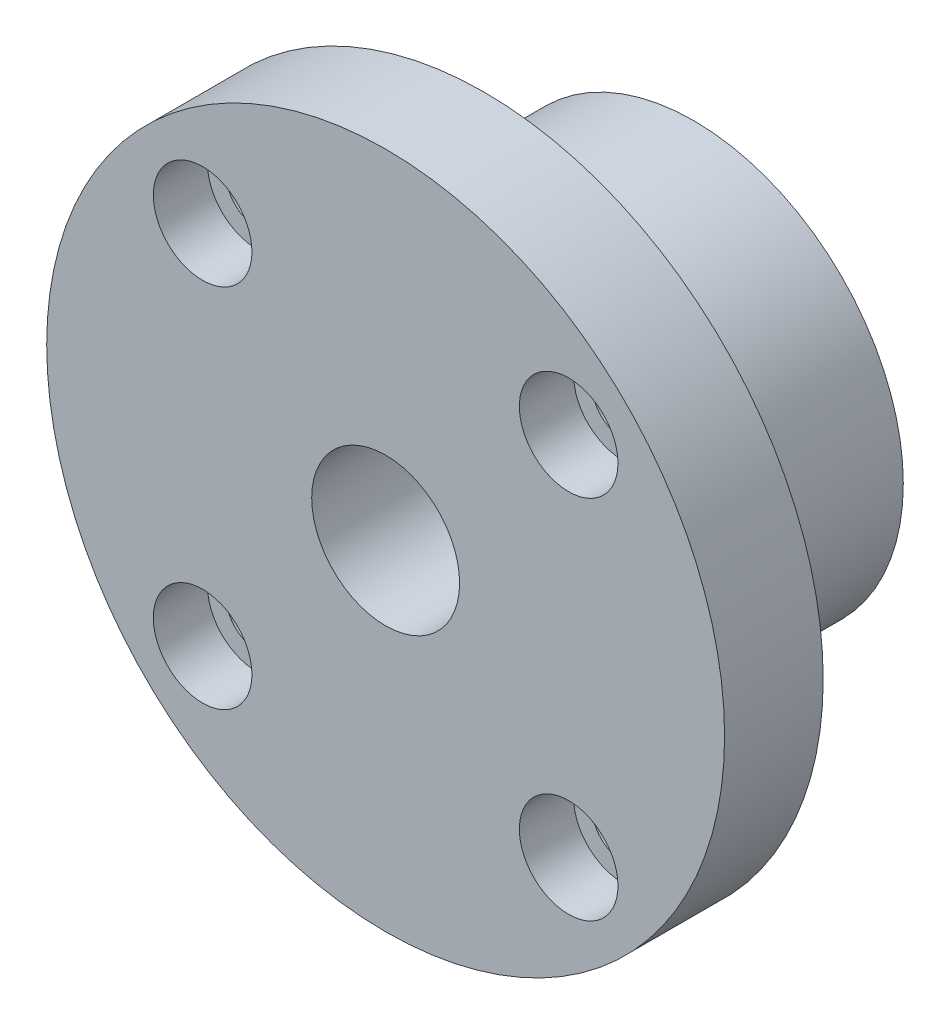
ISO-10303-21;
HEADER;
FILE_DESCRIPTION(('STEP AP214'),'2;1');
FILE_NAME('part.step','',(''),(''),'','','');
FILE_SCHEMA(('AUTOMOTIVE_DESIGN { 1 0 10303 214 1 1 1 1 }'));
ENDSEC;
DATA;
#1=APPLICATION_CONTEXT('core data for automotive mechanical design processes');
#2=APPLICATION_PROTOCOL_DEFINITION('international standard','automotive_design',2000,#1);
#3=PRODUCT_CONTEXT('',#1,'mechanical');
#4=PRODUCT('Part','Part','',(#3));
#5=PRODUCT_RELATED_PRODUCT_CATEGORY('part','',(#4));
#6=PRODUCT_DEFINITION_FORMATION('','',#4);
#7=PRODUCT_DEFINITION_CONTEXT('part definition',#1,'design');
#8=PRODUCT_DEFINITION('design','',#6,#7);
#9=PRODUCT_DEFINITION_SHAPE('','',#8);
#10=(LENGTH_UNIT() NAMED_UNIT(*) SI_UNIT(.MILLI.,.METRE.));
#11=(NAMED_UNIT(*) PLANE_ANGLE_UNIT() SI_UNIT($,.RADIAN.));
#12=(NAMED_UNIT(*) SI_UNIT($,.STERADIAN.) SOLID_ANGLE_UNIT());
#13=UNCERTAINTY_MEASURE_WITH_UNIT(LENGTH_MEASURE(1.E-05),#10,'distance_accuracy_value','');
#14=(GEOMETRIC_REPRESENTATION_CONTEXT(3) GLOBAL_UNCERTAINTY_ASSIGNED_CONTEXT((#13)) GLOBAL_UNIT_ASSIGNED_CONTEXT((#10,
#11,#12)) REPRESENTATION_CONTEXT('',''));
#15=CARTESIAN_POINT('',(0.,0.,0.));
#16=DIRECTION('',(0.,0.,1.));
#17=DIRECTION('',(1.,0.,0.));
#18=AXIS2_PLACEMENT_3D('',#15,#16,#17);
#19=CARTESIAN_POINT('',(0.,0.,0.));
#20=DIRECTION('',(0.,0.,1.));
#21=DIRECTION('',(1.,0.,0.));
#22=AXIS2_PLACEMENT_3D('',#19,#20,#21);
#23=PLANE('',#22);
#24=CARTESIAN_POINT('',(0.,0.,0.));
#25=DIRECTION('',(0.,0.,1.));
#26=DIRECTION('',(1.,0.,0.));
#27=AXIS2_PLACEMENT_3D('',#24,#25,#26);
#28=CIRCLE('',#27,27.5);
#29=CARTESIAN_POINT('',(27.5,0.,0.));
#30=VERTEX_POINT('',#29);
#31=EDGE_CURVE('E25',#30,#30,#28,.T.);
#32=ORIENTED_EDGE('',*,*,#31,.F.);
#33=EDGE_LOOP('',(#32));
#34=FACE_BOUND('',#33,.T.);
#35=CARTESIAN_POINT('',(14.8492424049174,14.8492424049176,0.));
#36=DIRECTION('',(0.,0.,1.));
#37=DIRECTION('',(1.,0.,0.));
#38=AXIS2_PLACEMENT_3D('',#35,#36,#37);
#39=CIRCLE('',#38,2.5);
#40=CARTESIAN_POINT('',(17.3492424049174,14.8492424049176,0.));
#41=VERTEX_POINT('',#40);
#42=EDGE_CURVE('E67',#41,#41,#39,.T.);
#43=ORIENTED_EDGE('',*,*,#42,.T.);
#44=EDGE_LOOP('',(#43));
#45=FACE_BOUND('',#44,.T.);
#46=CARTESIAN_POINT('',(14.8492424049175,-14.8492424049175,0.));
#47=DIRECTION('',(0.,0.,1.));
#48=DIRECTION('',(0.,-1.,0.));
#49=AXIS2_PLACEMENT_3D('',#46,#47,#48);
#50=CIRCLE('',#49,2.5);
#51=CARTESIAN_POINT('',(14.8492424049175,-17.3492424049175,0.));
#52=VERTEX_POINT('',#51);
#53=EDGE_CURVE('E57',#52,#52,#50,.T.);
#54=ORIENTED_EDGE('',*,*,#53,.T.);
#55=EDGE_LOOP('',(#54));
#56=FACE_BOUND('',#55,.T.);
#57=CARTESIAN_POINT('',(-14.8492424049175,-14.8492424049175,0.));
#58=DIRECTION('',(0.,0.,1.));
#59=DIRECTION('',(-1.,0.,0.));
#60=AXIS2_PLACEMENT_3D('',#57,#58,#59);
#61=CIRCLE('',#60,2.5);
#62=CARTESIAN_POINT('',(-17.3492424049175,-14.8492424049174,0.));
#63=VERTEX_POINT('',#62);
#64=EDGE_CURVE('E54',#63,#63,#61,.T.);
#65=ORIENTED_EDGE('',*,*,#64,.T.);
#66=EDGE_LOOP('',(#65));
#67=FACE_BOUND('',#66,.T.);
#68=CARTESIAN_POINT('',(-14.8492424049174,14.8492424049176,0.));
#69=DIRECTION('',(0.,0.,1.));
#70=DIRECTION('',(0.,1.,0.));
#71=AXIS2_PLACEMENT_3D('',#68,#69,#70);
#72=CIRCLE('',#71,2.5);
#73=CARTESIAN_POINT('',(-14.8492424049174,17.3492424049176,0.));
#74=VERTEX_POINT('',#73);
#75=EDGE_CURVE('E51',#74,#74,#72,.T.);
#76=ORIENTED_EDGE('',*,*,#75,.T.);
#77=EDGE_LOOP('',(#76));
#78=FACE_BOUND('',#77,.T.);
#79=CARTESIAN_POINT('',(0.,0.,0.));
#80=DIRECTION('',(0.,0.,1.));
#81=DIRECTION('',(1.,0.,0.));
#82=AXIS2_PLACEMENT_3D('',#79,#80,#81);
#83=CIRCLE('',#82,17.);
#84=CARTESIAN_POINT('',(17.,0.,0.));
#85=VERTEX_POINT('',#84);
#86=EDGE_CURVE('E8',#85,#85,#83,.F.);
#87=ORIENTED_EDGE('',*,*,#86,.F.);
#88=EDGE_LOOP('',(#87));
#89=FACE_BOUND('',#88,.T.);
#90=ADVANCED_FACE('F12',(#34,#45,#56,#67,#78,#89),#23,.F.);
#91=CARTESIAN_POINT('',(-14.8492424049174,14.8492424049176,0.));
#92=DIRECTION('',(0.,0.,1.));
#93=DIRECTION('',(1.,0.,0.));
#94=AXIS2_PLACEMENT_3D('',#91,#92,#93);
#95=CYLINDRICAL_SURFACE('',#94,2.5);
#96=ORIENTED_EDGE('',*,*,#75,.F.);
#97=EDGE_LOOP('',(#96));
#98=FACE_BOUND('',#97,.T.);
#99=CARTESIAN_POINT('',(-14.8492424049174,14.8492424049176,3.6));
#100=DIRECTION('',(0.,0.,1.));
#101=DIRECTION('',(1.,0.,0.));
#102=AXIS2_PLACEMENT_3D('',#99,#100,#101);
#103=CIRCLE('',#102,2.5);
#104=CARTESIAN_POINT('',(-12.3492424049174,14.8492424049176,3.6));
#105=VERTEX_POINT('',#104);
#106=EDGE_CURVE('E16',#105,#105,#103,.F.);
#107=ORIENTED_EDGE('',*,*,#106,.F.);
#108=EDGE_LOOP('',(#107));
#109=FACE_BOUND('',#108,.T.);
#110=ADVANCED_FACE('F86',(#98,#109),#95,.F.);
#111=CARTESIAN_POINT('',(-14.8492424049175,-14.8492424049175,0.));
#112=DIRECTION('',(0.,0.,1.));
#113=DIRECTION('',(1.,0.,0.));
#114=AXIS2_PLACEMENT_3D('',#111,#112,#113);
#115=CYLINDRICAL_SURFACE('',#114,2.5);
#116=ORIENTED_EDGE('',*,*,#64,.F.);
#117=EDGE_LOOP('',(#116));
#118=FACE_BOUND('',#117,.T.);
#119=CARTESIAN_POINT('',(-14.8492424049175,-14.8492424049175,3.6));
#120=DIRECTION('',(0.,0.,1.));
#121=DIRECTION('',(1.,0.,0.));
#122=AXIS2_PLACEMENT_3D('',#119,#120,#121);
#123=CIRCLE('',#122,2.5);
#124=CARTESIAN_POINT('',(-12.3492424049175,-14.8492424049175,3.6));
#125=VERTEX_POINT('',#124);
#126=EDGE_CURVE('E43',#125,#125,#123,.F.);
#127=ORIENTED_EDGE('',*,*,#126,.F.);
#128=EDGE_LOOP('',(#127));
#129=FACE_BOUND('',#128,.T.);
#130=ADVANCED_FACE('F83',(#118,#129),#115,.F.);
#131=CARTESIAN_POINT('',(14.8492424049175,-14.8492424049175,0.));
#132=DIRECTION('',(0.,0.,1.));
#133=DIRECTION('',(1.,0.,0.));
#134=AXIS2_PLACEMENT_3D('',#131,#132,#133);
#135=CYLINDRICAL_SURFACE('',#134,2.5);
#136=ORIENTED_EDGE('',*,*,#53,.F.);
#137=EDGE_LOOP('',(#136));
#138=FACE_BOUND('',#137,.T.);
#139=CARTESIAN_POINT('',(14.8492424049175,-14.8492424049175,3.6));
#140=DIRECTION('',(0.,0.,1.));
#141=DIRECTION('',(1.,0.,0.));
#142=AXIS2_PLACEMENT_3D('',#139,#140,#141);
#143=CIRCLE('',#142,2.5);
#144=CARTESIAN_POINT('',(17.3492424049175,-14.8492424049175,3.6));
#145=VERTEX_POINT('',#144);
#146=EDGE_CURVE('E50',#145,#145,#143,.F.);
#147=ORIENTED_EDGE('',*,*,#146,.F.);
#148=EDGE_LOOP('',(#147));
#149=FACE_BOUND('',#148,.T.);
#150=ADVANCED_FACE('F85',(#138,#149),#135,.F.);
#151=CARTESIAN_POINT('',(14.8492424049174,14.8492424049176,0.));
#152=DIRECTION('',(0.,0.,1.));
#153=DIRECTION('',(1.,0.,0.));
#154=AXIS2_PLACEMENT_3D('',#151,#152,#153);
#155=CYLINDRICAL_SURFACE('',#154,2.5);
#156=ORIENTED_EDGE('',*,*,#42,.F.);
#157=EDGE_LOOP('',(#156));
#158=FACE_BOUND('',#157,.T.);
#159=CARTESIAN_POINT('',(14.8492424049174,14.8492424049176,3.6));
#160=DIRECTION('',(0.,0.,1.));
#161=DIRECTION('',(1.,0.,0.));
#162=AXIS2_PLACEMENT_3D('',#159,#160,#161);
#163=CIRCLE('',#162,2.5);
#164=CARTESIAN_POINT('',(17.3492424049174,14.8492424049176,3.6));
#165=VERTEX_POINT('',#164);
#166=EDGE_CURVE('E66',#165,#165,#163,.F.);
#167=ORIENTED_EDGE('',*,*,#166,.F.);
#168=EDGE_LOOP('',(#167));
#169=FACE_BOUND('',#168,.T.);
#170=ADVANCED_FACE('F94',(#158,#169),#155,.F.);
#171=CARTESIAN_POINT('',(0.,0.,8.));
#172=DIRECTION('',(0.,0.,1.));
#173=DIRECTION('',(1.,0.,0.));
#174=AXIS2_PLACEMENT_3D('',#171,#172,#173);
#175=PLANE('',#174);
#176=CARTESIAN_POINT('',(-14.8492424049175,-14.8492424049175,8.));
#177=DIRECTION('',(0.,0.,1.));
#178=DIRECTION('',(-1.,0.,0.));
#179=AXIS2_PLACEMENT_3D('',#176,#177,#178);
#180=CIRCLE('',#179,4.);
#181=CARTESIAN_POINT('',(-18.8492424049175,-14.8492424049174,8.));
#182=VERTEX_POINT('',#181);
#183=EDGE_CURVE('E37',#182,#182,#180,.T.);
#184=ORIENTED_EDGE('',*,*,#183,.F.);
#185=EDGE_LOOP('',(#184));
#186=FACE_BOUND('',#185,.T.);
#187=CARTESIAN_POINT('',(-14.8492424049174,14.8492424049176,8.));
#188=DIRECTION('',(0.,0.,1.));
#189=DIRECTION('',(0.,1.,0.));
#190=AXIS2_PLACEMENT_3D('',#187,#188,#189);
#191=CIRCLE('',#190,4.);
#192=CARTESIAN_POINT('',(-14.8492424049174,18.8492424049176,8.));
#193=VERTEX_POINT('',#192);
#194=EDGE_CURVE('E31',#193,#193,#191,.T.);
#195=ORIENTED_EDGE('',*,*,#194,.F.);
#196=EDGE_LOOP('',(#195));
#197=FACE_BOUND('',#196,.T.);
#198=CARTESIAN_POINT('',(14.8492424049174,14.8492424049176,8.));
#199=DIRECTION('',(0.,0.,1.));
#200=DIRECTION('',(1.,0.,0.));
#201=AXIS2_PLACEMENT_3D('',#198,#199,#200);
#202=CIRCLE('',#201,4.);
#203=CARTESIAN_POINT('',(18.8492424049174,14.8492424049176,8.));
#204=VERTEX_POINT('',#203);
#205=EDGE_CURVE('E60',#204,#204,#202,.T.);
#206=ORIENTED_EDGE('',*,*,#205,.F.);
#207=EDGE_LOOP('',(#206));
#208=FACE_BOUND('',#207,.T.);
#209=CARTESIAN_POINT('',(14.8492424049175,-14.8492424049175,8.));
#210=DIRECTION('',(0.,0.,1.));
#211=DIRECTION('',(0.,-1.,0.));
#212=AXIS2_PLACEMENT_3D('',#209,#210,#211);
#213=CIRCLE('',#212,4.);
#214=CARTESIAN_POINT('',(14.8492424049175,-18.8492424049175,8.));
#215=VERTEX_POINT('',#214);
#216=EDGE_CURVE('E44',#215,#215,#213,.T.);
#217=ORIENTED_EDGE('',*,*,#216,.F.);
#218=EDGE_LOOP('',(#217));
#219=FACE_BOUND('',#218,.T.);
#220=CARTESIAN_POINT('',(0.,0.,8.));
#221=DIRECTION('',(0.,0.,1.));
#222=DIRECTION('',(1.,0.,0.));
#223=AXIS2_PLACEMENT_3D('',#220,#221,#222);
#224=CIRCLE('',#223,6.);
#225=CARTESIAN_POINT('',(6.,0.,8.));
#226=VERTEX_POINT('',#225);
#227=EDGE_CURVE('E70',#226,#226,#224,.T.);
#228=ORIENTED_EDGE('',*,*,#227,.F.);
#229=EDGE_LOOP('',(#228));
#230=FACE_BOUND('',#229,.T.);
#231=CARTESIAN_POINT('',(0.,0.,8.));
#232=DIRECTION('',(0.,0.,1.));
#233=DIRECTION('',(1.,0.,0.));
#234=AXIS2_PLACEMENT_3D('',#231,#232,#233);
#235=CIRCLE('',#234,27.5);
#236=CARTESIAN_POINT('',(27.5,0.,8.));
#237=VERTEX_POINT('',#236);
#238=EDGE_CURVE('E20',#237,#237,#235,.T.);
#239=ORIENTED_EDGE('',*,*,#238,.T.);
#240=EDGE_LOOP('',(#239));
#241=FACE_BOUND('',#240,.T.);
#242=ADVANCED_FACE('F110',(#186,#197,#208,#219,#230,#241),#175,.T.);
#243=CARTESIAN_POINT('',(0.,0.,8.));
#244=DIRECTION('',(0.,0.,-1.));
#245=DIRECTION('',(-1.,0.,0.));
#246=AXIS2_PLACEMENT_3D('',#243,#244,#245);
#247=CYLINDRICAL_SURFACE('',#246,27.5);
#248=ORIENTED_EDGE('',*,*,#238,.F.);
#249=EDGE_LOOP('',(#248));
#250=FACE_BOUND('',#249,.T.);
#251=ORIENTED_EDGE('',*,*,#31,.T.);
#252=EDGE_LOOP('',(#251));
#253=FACE_BOUND('',#252,.T.);
#254=ADVANCED_FACE('F14',(#250,#253),#247,.T.);
#255=CARTESIAN_POINT('',(0.,0.,8.));
#256=DIRECTION('',(0.,0.,-1.));
#257=DIRECTION('',(-1.,0.,0.));
#258=AXIS2_PLACEMENT_3D('',#255,#256,#257);
#259=CYLINDRICAL_SURFACE('',#258,6.);
#260=ORIENTED_EDGE('',*,*,#227,.T.);
#261=EDGE_LOOP('',(#260));
#262=FACE_BOUND('',#261,.T.);
#263=CARTESIAN_POINT('',(0.,0.,-17.));
#264=DIRECTION('',(0.,0.,-1.));
#265=DIRECTION('',(-1.,0.,0.));
#266=AXIS2_PLACEMENT_3D('',#263,#264,#265);
#267=CIRCLE('',#266,6.);
#268=CARTESIAN_POINT('',(-6.,0.,-17.));
#269=VERTEX_POINT('',#268);
#270=EDGE_CURVE('E137',#269,#269,#267,.T.);
#271=ORIENTED_EDGE('',*,*,#270,.T.);
#272=EDGE_LOOP('',(#271));
#273=FACE_BOUND('',#272,.T.);
#274=ADVANCED_FACE('F108',(#262,#273),#259,.F.);
#275=CARTESIAN_POINT('',(14.8492424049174,14.8492424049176,3.6));
#276=DIRECTION('',(0.,0.,1.));
#277=DIRECTION('',(1.,0.,0.));
#278=AXIS2_PLACEMENT_3D('',#275,#276,#277);
#279=PLANE('',#278);
#280=CARTESIAN_POINT('',(14.8492424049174,14.8492424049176,3.6));
#281=DIRECTION('',(0.,0.,1.));
#282=DIRECTION('',(1.,0.,0.));
#283=AXIS2_PLACEMENT_3D('',#280,#281,#282);
#284=CIRCLE('',#283,4.);
#285=CARTESIAN_POINT('',(18.8492424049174,14.8492424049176,3.6));
#286=VERTEX_POINT('',#285);
#287=EDGE_CURVE('E63',#286,#286,#284,.T.);
#288=ORIENTED_EDGE('',*,*,#287,.T.);
#289=EDGE_LOOP('',(#288));
#290=FACE_BOUND('',#289,.T.);
#291=ORIENTED_EDGE('',*,*,#166,.T.);
#292=EDGE_LOOP('',(#291));
#293=FACE_BOUND('',#292,.T.);
#294=ADVANCED_FACE('F134',(#290,#293),#279,.T.);
#295=CARTESIAN_POINT('',(14.8492424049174,14.8492424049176,3.6));
#296=DIRECTION('',(0.,0.,1.));
#297=DIRECTION('',(1.,0.,0.));
#298=AXIS2_PLACEMENT_3D('',#295,#296,#297);
#299=CYLINDRICAL_SURFACE('',#298,4.);
#300=ORIENTED_EDGE('',*,*,#205,.T.);
#301=EDGE_LOOP('',(#300));
#302=FACE_BOUND('',#301,.T.);
#303=ORIENTED_EDGE('',*,*,#287,.F.);
#304=EDGE_LOOP('',(#303));
#305=FACE_BOUND('',#304,.T.);
#306=ADVANCED_FACE('F171',(#302,#305),#299,.F.);
#307=CARTESIAN_POINT('',(14.8492424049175,-14.8492424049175,3.6));
#308=DIRECTION('',(0.,0.,1.));
#309=DIRECTION('',(0.,-1.,0.));
#310=AXIS2_PLACEMENT_3D('',#307,#308,#309);
#311=PLANE('',#310);
#312=CARTESIAN_POINT('',(14.8492424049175,-14.8492424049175,3.6));
#313=DIRECTION('',(0.,0.,1.));
#314=DIRECTION('',(0.,-1.,0.));
#315=AXIS2_PLACEMENT_3D('',#312,#313,#314);
#316=CIRCLE('',#315,4.);
#317=CARTESIAN_POINT('',(14.8492424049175,-18.8492424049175,3.6));
#318=VERTEX_POINT('',#317);
#319=EDGE_CURVE('E47',#318,#318,#316,.T.);
#320=ORIENTED_EDGE('',*,*,#319,.T.);
#321=EDGE_LOOP('',(#320));
#322=FACE_BOUND('',#321,.T.);
#323=ORIENTED_EDGE('',*,*,#146,.T.);
#324=EDGE_LOOP('',(#323));
#325=FACE_BOUND('',#324,.T.);
#326=ADVANCED_FACE('F168',(#322,#325),#311,.T.);
#327=CARTESIAN_POINT('',(14.8492424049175,-14.8492424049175,3.6));
#328=DIRECTION('',(0.,0.,1.));
#329=DIRECTION('',(1.,0.,0.));
#330=AXIS2_PLACEMENT_3D('',#327,#328,#329);
#331=CYLINDRICAL_SURFACE('',#330,4.);
#332=ORIENTED_EDGE('',*,*,#216,.T.);
#333=EDGE_LOOP('',(#332));
#334=FACE_BOUND('',#333,.T.);
#335=ORIENTED_EDGE('',*,*,#319,.F.);
#336=EDGE_LOOP('',(#335));
#337=FACE_BOUND('',#336,.T.);
#338=ADVANCED_FACE('F163',(#334,#337),#331,.F.);
#339=CARTESIAN_POINT('',(-14.8492424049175,-14.8492424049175,3.6));
#340=DIRECTION('',(0.,0.,1.));
#341=DIRECTION('',(-1.,0.,0.));
#342=AXIS2_PLACEMENT_3D('',#339,#340,#341);
#343=PLANE('',#342);
#344=CARTESIAN_POINT('',(-14.8492424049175,-14.8492424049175,3.6));
#345=DIRECTION('',(0.,0.,1.));
#346=DIRECTION('',(-1.,0.,0.));
#347=AXIS2_PLACEMENT_3D('',#344,#345,#346);
#348=CIRCLE('',#347,4.);
#349=CARTESIAN_POINT('',(-18.8492424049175,-14.8492424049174,3.6));
#350=VERTEX_POINT('',#349);
#351=EDGE_CURVE('E40',#350,#350,#348,.T.);
#352=ORIENTED_EDGE('',*,*,#351,.T.);
#353=EDGE_LOOP('',(#352));
#354=FACE_BOUND('',#353,.T.);
#355=ORIENTED_EDGE('',*,*,#126,.T.);
#356=EDGE_LOOP('',(#355));
#357=FACE_BOUND('',#356,.T.);
#358=ADVANCED_FACE('F81',(#354,#357),#343,.T.);
#359=CARTESIAN_POINT('',(-14.8492424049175,-14.8492424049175,3.6));
#360=DIRECTION('',(0.,0.,1.));
#361=DIRECTION('',(1.,0.,0.));
#362=AXIS2_PLACEMENT_3D('',#359,#360,#361);
#363=CYLINDRICAL_SURFACE('',#362,4.);
#364=ORIENTED_EDGE('',*,*,#183,.T.);
#365=EDGE_LOOP('',(#364));
#366=FACE_BOUND('',#365,.T.);
#367=ORIENTED_EDGE('',*,*,#351,.F.);
#368=EDGE_LOOP('',(#367));
#369=FACE_BOUND('',#368,.T.);
#370=ADVANCED_FACE('F158',(#366,#369),#363,.F.);
#371=CARTESIAN_POINT('',(-14.8492424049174,14.8492424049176,3.6));
#372=DIRECTION('',(0.,0.,1.));
#373=DIRECTION('',(0.,1.,0.));
#374=AXIS2_PLACEMENT_3D('',#371,#372,#373);
#375=PLANE('',#374);
#376=CARTESIAN_POINT('',(-14.8492424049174,14.8492424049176,3.6));
#377=DIRECTION('',(0.,0.,1.));
#378=DIRECTION('',(0.,1.,0.));
#379=AXIS2_PLACEMENT_3D('',#376,#377,#378);
#380=CIRCLE('',#379,4.);
#381=CARTESIAN_POINT('',(-14.8492424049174,18.8492424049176,3.6));
#382=VERTEX_POINT('',#381);
#383=EDGE_CURVE('E34',#382,#382,#380,.T.);
#384=ORIENTED_EDGE('',*,*,#383,.T.);
#385=EDGE_LOOP('',(#384));
#386=FACE_BOUND('',#385,.T.);
#387=ORIENTED_EDGE('',*,*,#106,.T.);
#388=EDGE_LOOP('',(#387));
#389=FACE_BOUND('',#388,.T.);
#390=ADVANCED_FACE('F153',(#386,#389),#375,.T.);
#391=CARTESIAN_POINT('',(-14.8492424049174,14.8492424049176,3.6));
#392=DIRECTION('',(0.,0.,1.));
#393=DIRECTION('',(1.,0.,0.));
#394=AXIS2_PLACEMENT_3D('',#391,#392,#393);
#395=CYLINDRICAL_SURFACE('',#394,4.);
#396=ORIENTED_EDGE('',*,*,#194,.T.);
#397=EDGE_LOOP('',(#396));
#398=FACE_BOUND('',#397,.T.);
#399=ORIENTED_EDGE('',*,*,#383,.F.);
#400=EDGE_LOOP('',(#399));
#401=FACE_BOUND('',#400,.T.);
#402=ADVANCED_FACE('F146',(#398,#401),#395,.F.);
#403=CARTESIAN_POINT('',(0.,0.,-17.));
#404=DIRECTION('',(0.,0.,1.));
#405=DIRECTION('',(1.,0.,0.));
#406=AXIS2_PLACEMENT_3D('',#403,#404,#405);
#407=CYLINDRICAL_SURFACE('',#406,17.);
#408=CARTESIAN_POINT('',(0.,0.,-17.));
#409=DIRECTION('',(0.,0.,-1.));
#410=DIRECTION('',(-1.,0.,0.));
#411=AXIS2_PLACEMENT_3D('',#408,#409,#410);
#412=CIRCLE('',#411,17.);
#413=CARTESIAN_POINT('',(-17.,0.,-17.));
#414=VERTEX_POINT('',#413);
#415=EDGE_CURVE('E29',#414,#414,#412,.T.);
#416=ORIENTED_EDGE('',*,*,#415,.F.);
#417=EDGE_LOOP('',(#416));
#418=FACE_BOUND('',#417,.T.);
#419=ORIENTED_EDGE('',*,*,#86,.T.);
#420=EDGE_LOOP('',(#419));
#421=FACE_BOUND('',#420,.T.);
#422=ADVANCED_FACE('F144',(#418,#421),#407,.T.);
#423=CARTESIAN_POINT('',(0.,0.,-17.));
#424=DIRECTION('',(0.,0.,-1.));
#425=DIRECTION('',(-1.,0.,0.));
#426=AXIS2_PLACEMENT_3D('',#423,#424,#425);
#427=PLANE('',#426);
#428=ORIENTED_EDGE('',*,*,#415,.T.);
#429=EDGE_LOOP('',(#428));
#430=FACE_BOUND('',#429,.T.);
#431=ORIENTED_EDGE('',*,*,#270,.F.);
#432=EDGE_LOOP('',(#431));
#433=FACE_BOUND('',#432,.T.);
#434=ADVANCED_FACE('F142',(#430,#433),#427,.T.);
#435=CLOSED_SHELL('',(#90,#110,#130,#150,#170,#242,#254,#274,#294,#306,#326,#338,#358,#370,#390,
#402,#422,#434));
#436=MANIFOLD_SOLID_BREP('B1',#435);
#437=ADVANCED_BREP_SHAPE_REPRESENTATION('',(#18,#436),#14);
#438=SHAPE_DEFINITION_REPRESENTATION(#9,#437);
ENDSEC;
END-ISO-10303-21;
